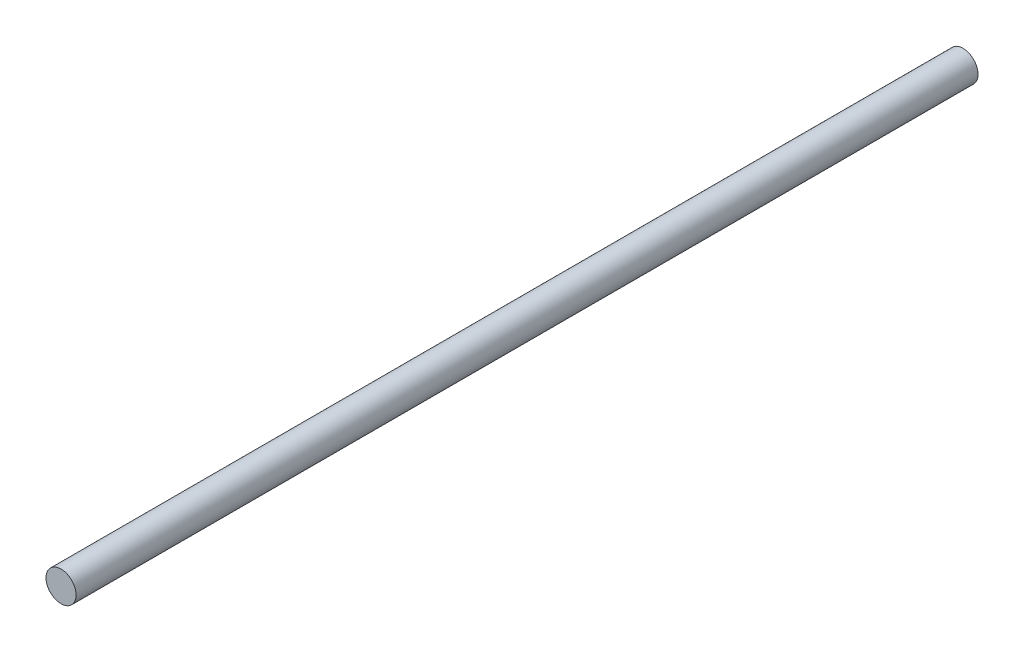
from build123d import *

# Parameters (mm, degrees)
SKETCH1_R      = 3
EXTRUDE1_DEPTH = 180


with BuildPart() as part:
    # Sketch1 → Extrude1 (new body)
    with BuildSketch(Plane.XY):
        with Locations(Location((0, 0, 0), (0, 0, 180))):
            Circle(SKETCH1_R)
    extrude(amount=EXTRUDE1_DEPTH)


solid = part.part
